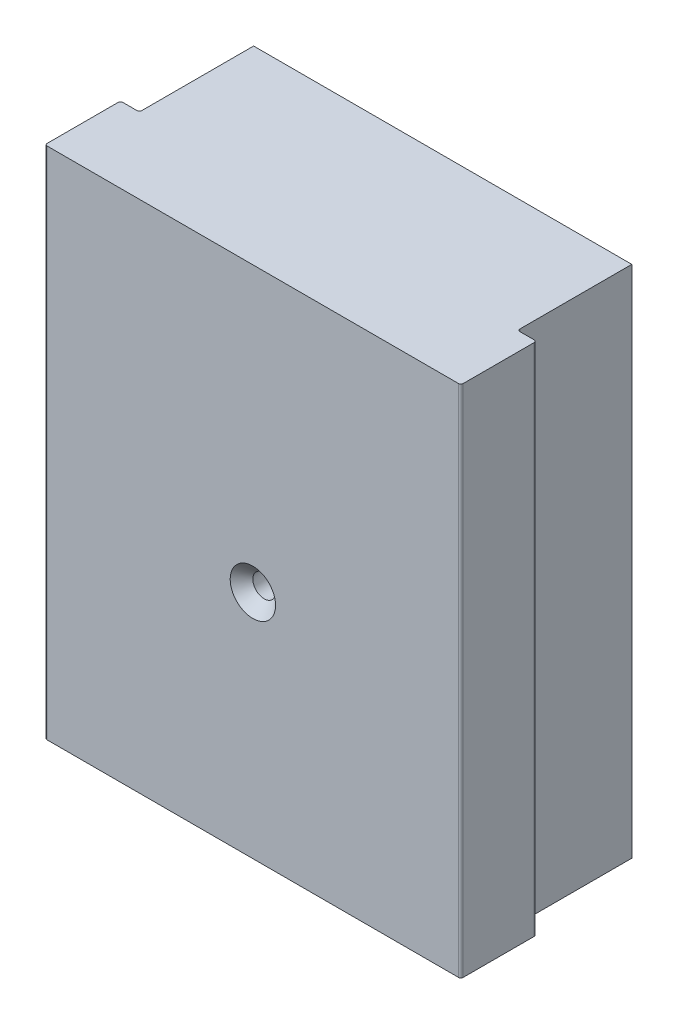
from build123d import *

# Parameters (mm, degrees)
SECTION_PROFIL_DEPTH             = 68
CONG_2_R                         = 0.3
ESQUISSE2_R                      = 1.5
CAROTTE_CENTRALE_DEPTH           = 78.053293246
CAROTTE_CENTRALE_DRAFT           = 2
ESQUISSE3_R                      = 1.5
C_NE_D_APPUI_BUSE_CENTRALE_DEPTH = 68
C_NE_D_APPUI_BUSE_CENTRALE_DRAFT = 45


with BuildPart() as part:
    # Esquisse1 → section profil (new body)
    with BuildSketch(Plane(origin=(0, 0, 0), x_dir=(1, 0, 0), z_dir=(0, 1, 0))):
        Polygon((-25, 25.1), (25, 25.1), (25, 10), (27.5, 10), (27.5, 0), (-27.5, 0), (-27.5, 10), (-25, 10), align=None)
    extrude(amount=SECTION_PROFIL_DEPTH)

    # Cong_2
    cong_2_edges = [part.edges().sort_by_distance(p)[0] for p in [
        (27.5, 34, 0),
        (-27.5, 34, 0),
        (-27.5, 34, -10),
        (-25, 34, -10),
        (25, 34, -10),
        (27.5, 34, -10),
    ]]
    fillet(cong_2_edges, radius=CONG_2_R)


with BuildPart() as carotte_centrale_tool:
    # Esquisse2 → carotte centrale (with draft: the straight prism first)
    with BuildSketch(Plane.XY.offset(-1.5)):
        with Locations((0, 30.5)):
            Circle(ESQUISSE2_R)
    extrude(amount=-CAROTTE_CENTRALE_DEPTH)
    # carotte centrale: the draft: its side faces are tilted about the plane it starts from
    carotte_centrale_sides = [carotte_centrale_tool.faces().sort_by_distance(p)[0] for p in [
        (-1.5, 30.5, -40.526646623),
    ]]
    draft(carotte_centrale_sides, Plane.XY.offset(-1.5), CAROTTE_CENTRALE_DRAFT)


with BuildPart() as part_1:
    add(part.part)

    # carotte centrale: cut by carotte_centrale_tool
    add(carotte_centrale_tool.part, mode=Mode.SUBTRACT)


with BuildPart() as c_ne_d_appui_buse_centrale_tool:
    # Esquisse3 → c_ne d_appui buse centrale (with draft: the straight prism first)
    with BuildSketch(Plane(origin=(0, 0, -1.5), x_dir=(-1, 0, 0), z_dir=(0, 0, -1))):
        with Locations((0, 30.5)):
            Circle(ESQUISSE3_R)
    extrude(amount=-C_NE_D_APPUI_BUSE_CENTRALE_DEPTH)
    # c_ne d_appui buse centrale: the draft: its side faces are tilted about the plane it starts from
    c_ne_d_appui_buse_centrale_sides = [c_ne_d_appui_buse_centrale_tool.faces().sort_by_distance(p)[0] for p in [
        (1.5, 30.5, 32.5),
    ]]
    draft(c_ne_d_appui_buse_centrale_sides, Plane(origin=(0, 0, -1.5), x_dir=(-1, 0, 0), z_dir=(0, 0, -1)), C_NE_D_APPUI_BUSE_CENTRALE_DRAFT)


with BuildPart() as part_2:
    add(part_1.part)

    # c_ne d_appui buse centrale: cut by c_ne_d_appui_buse_centrale_tool
    add(c_ne_d_appui_buse_centrale_tool.part, mode=Mode.SUBTRACT)


solid = part_2.part
